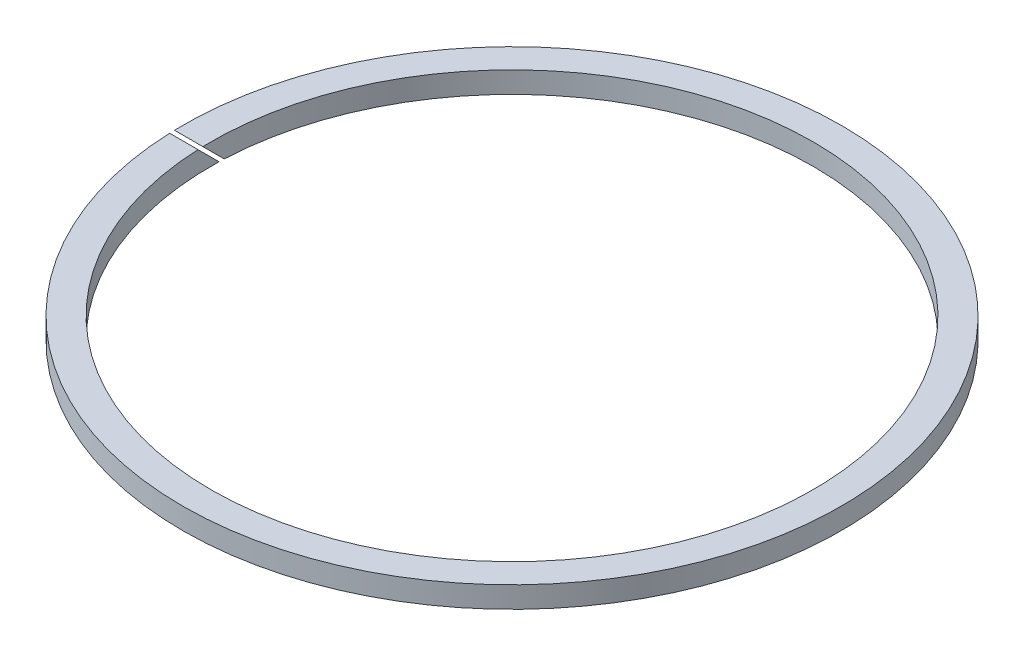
ISO-10303-21;
HEADER;
FILE_DESCRIPTION(('STEP AP214'),'2;1');
FILE_NAME('part.step','',(''),(''),'','','');
FILE_SCHEMA(('AUTOMOTIVE_DESIGN { 1 0 10303 214 1 1 1 1 }'));
ENDSEC;
DATA;
#1=APPLICATION_CONTEXT('core data for automotive mechanical design processes');
#2=APPLICATION_PROTOCOL_DEFINITION('international standard','automotive_design',2000,#1);
#3=PRODUCT_CONTEXT('',#1,'mechanical');
#4=PRODUCT('Part','Part','',(#3));
#5=PRODUCT_RELATED_PRODUCT_CATEGORY('part','',(#4));
#6=PRODUCT_DEFINITION_FORMATION('','',#4);
#7=PRODUCT_DEFINITION_CONTEXT('part definition',#1,'design');
#8=PRODUCT_DEFINITION('design','',#6,#7);
#9=PRODUCT_DEFINITION_SHAPE('','',#8);
#10=(LENGTH_UNIT() NAMED_UNIT(*) SI_UNIT(.MILLI.,.METRE.));
#11=(NAMED_UNIT(*) PLANE_ANGLE_UNIT() SI_UNIT($,.RADIAN.));
#12=(NAMED_UNIT(*) SI_UNIT($,.STERADIAN.) SOLID_ANGLE_UNIT());
#13=UNCERTAINTY_MEASURE_WITH_UNIT(LENGTH_MEASURE(1.E-05),#10,'distance_accuracy_value','');
#14=(GEOMETRIC_REPRESENTATION_CONTEXT(3) GLOBAL_UNCERTAINTY_ASSIGNED_CONTEXT((#13)) GLOBAL_UNIT_ASSIGNED_CONTEXT((#10,
#11,#12)) REPRESENTATION_CONTEXT('',''));
#15=CARTESIAN_POINT('',(0.,0.,0.));
#16=DIRECTION('',(0.,0.,1.));
#17=DIRECTION('',(1.,0.,0.));
#18=AXIS2_PLACEMENT_3D('',#15,#16,#17);
#19=CARTESIAN_POINT('',(0.,1.5,0.));
#20=DIRECTION('',(0.,1.,0.));
#21=DIRECTION('',(0.,0.,1.));
#22=AXIS2_PLACEMENT_3D('',#19,#20,#21);
#23=PLANE('',#22);
#24=DIRECTION('',(1.,0.,0.));
#25=VECTOR('',#24,1.);
#26=CARTESIAN_POINT('',(-46.5,1.5,1.14644660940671));
#27=LINE('',#26,#25);
#28=CARTESIAN_POINT('',(-46.4858651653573,1.5,1.14644660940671));
#29=VERTEX_POINT('',#28);
#30=CARTESIAN_POINT('',(-42.48453436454,1.5,1.14644660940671));
#31=VERTEX_POINT('',#30);
#32=EDGE_CURVE('E79',#29,#31,#27,.T.);
#33=ORIENTED_EDGE('',*,*,#32,.T.);
#34=CARTESIAN_POINT('',(0.,1.5,0.));
#35=DIRECTION('',(0.,1.,0.));
#36=DIRECTION('',(0.,0.,1.));
#37=AXIS2_PLACEMENT_3D('',#34,#35,#36);
#38=CIRCLE('',#37,42.5);
#39=CARTESIAN_POINT('',(-42.4595612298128,1.5,1.85355339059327));
#40=VERTEX_POINT('',#39);
#41=EDGE_CURVE('E87',#40,#31,#38,.T.);
#42=ORIENTED_EDGE('',*,*,#41,.F.);
#43=DIRECTION('',(1.,0.,0.));
#44=VECTOR('',#43,1.);
#45=CARTESIAN_POINT('',(-46.5,1.5,1.85355339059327));
#46=LINE('',#45,#44);
#47=CARTESIAN_POINT('',(-46.4630427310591,1.5,1.85355339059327));
#48=VERTEX_POINT('',#47);
#49=EDGE_CURVE('E54',#48,#40,#46,.T.);
#50=ORIENTED_EDGE('',*,*,#49,.F.);
#51=CARTESIAN_POINT('',(0.,1.5,0.));
#52=DIRECTION('',(0.,1.,0.));
#53=DIRECTION('',(0.,0.,1.));
#54=AXIS2_PLACEMENT_3D('',#51,#52,#53);
#55=CIRCLE('',#54,46.5);
#56=EDGE_CURVE('E85',#48,#29,#55,.T.);
#57=ORIENTED_EDGE('',*,*,#56,.T.);
#58=EDGE_LOOP('',(#33,#42,#50,#57));
#59=FACE_BOUND('',#58,.T.);
#60=ADVANCED_FACE('F32',(#59),#23,.T.);
#61=CARTESIAN_POINT('',(0.,-1.5,0.));
#62=DIRECTION('',(0.,1.,0.));
#63=DIRECTION('',(0.,0.,1.));
#64=AXIS2_PLACEMENT_3D('',#61,#62,#63);
#65=PLANE('',#64);
#66=CARTESIAN_POINT('',(0.,-1.5,0.));
#67=DIRECTION('',(0.,1.,0.));
#68=DIRECTION('',(0.,0.,1.));
#69=AXIS2_PLACEMENT_3D('',#66,#67,#68);
#70=CIRCLE('',#69,42.5);
#71=CARTESIAN_POINT('',(-42.48453436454,-1.5,-1.14644660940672));
#72=VERTEX_POINT('',#71);
#73=CARTESIAN_POINT('',(-42.4595612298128,-1.5,-1.85355339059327));
#74=VERTEX_POINT('',#73);
#75=EDGE_CURVE('E95',#72,#74,#70,.T.);
#76=ORIENTED_EDGE('',*,*,#75,.T.);
#77=DIRECTION('',(1.,0.,0.));
#78=VECTOR('',#77,1.);
#79=CARTESIAN_POINT('',(-46.5,-1.5,-1.85355339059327));
#80=LINE('',#79,#78);
#81=CARTESIAN_POINT('',(-46.4630427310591,-1.5,-1.85355339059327));
#82=VERTEX_POINT('',#81);
#83=EDGE_CURVE('E46',#82,#74,#80,.T.);
#84=ORIENTED_EDGE('',*,*,#83,.F.);
#85=CARTESIAN_POINT('',(0.,-1.5,0.));
#86=DIRECTION('',(0.,1.,0.));
#87=DIRECTION('',(0.,0.,1.));
#88=AXIS2_PLACEMENT_3D('',#85,#86,#87);
#89=CIRCLE('',#88,46.5);
#90=CARTESIAN_POINT('',(-46.4858651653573,-1.5,-1.14644660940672));
#91=VERTEX_POINT('',#90);
#92=EDGE_CURVE('E90',#91,#82,#89,.T.);
#93=ORIENTED_EDGE('',*,*,#92,.F.);
#94=DIRECTION('',(1.,0.,0.));
#95=VECTOR('',#94,1.);
#96=CARTESIAN_POINT('',(-46.5,-1.5,-1.14644660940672));
#97=LINE('',#96,#95);
#98=EDGE_CURVE('E73',#91,#72,#97,.T.);
#99=ORIENTED_EDGE('',*,*,#98,.T.);
#100=EDGE_LOOP('',(#76,#84,#93,#99));
#101=FACE_BOUND('',#100,.T.);
#102=ADVANCED_FACE('F105',(#101),#65,.F.);
#103=CARTESIAN_POINT('',(0.,1.5,0.));
#104=DIRECTION('',(0.,-1.,0.));
#105=DIRECTION('',(0.,0.,-1.));
#106=AXIS2_PLACEMENT_3D('',#103,#104,#105);
#107=CYLINDRICAL_SURFACE('',#106,46.5);
#108=ORIENTED_EDGE('',*,*,#92,.T.);
#109=CARTESIAN_POINT('',(0.,0.353553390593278,0.));
#110=DIRECTION('',(0.,0.707106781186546,-0.707106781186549));
#111=DIRECTION('',(0.,-0.707106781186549,-0.707106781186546));
#112=AXIS2_PLACEMENT_3D('',#109,#110,#111);
#113=ELLIPSE('',#112,65.7609306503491,46.5);
#114=EDGE_CURVE('E78',#82,#29,#113,.T.);
#115=ORIENTED_EDGE('',*,*,#114,.T.);
#116=ORIENTED_EDGE('',*,*,#56,.F.);
#117=CARTESIAN_POINT('',(0.,-0.353553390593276,0.));
#118=DIRECTION('',(0.,-0.707106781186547,0.707106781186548));
#119=DIRECTION('',(0.,-0.707106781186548,-0.707106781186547));
#120=AXIS2_PLACEMENT_3D('',#117,#118,#119);
#121=ELLIPSE('',#120,65.760930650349,46.5);
#122=EDGE_CURVE('E70',#48,#91,#121,.T.);
#123=ORIENTED_EDGE('',*,*,#122,.T.);
#124=EDGE_LOOP('',(#108,#115,#116,#123));
#125=FACE_BOUND('',#124,.T.);
#126=ADVANCED_FACE('F34',(#125),#107,.T.);
#127=CARTESIAN_POINT('',(0.,1.5,0.));
#128=DIRECTION('',(0.,-1.,0.));
#129=DIRECTION('',(0.,0.,-1.));
#130=AXIS2_PLACEMENT_3D('',#127,#128,#129);
#131=CYLINDRICAL_SURFACE('',#130,42.5);
#132=CARTESIAN_POINT('',(0.,0.353553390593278,0.));
#133=DIRECTION('',(0.,0.707106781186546,-0.707106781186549));
#134=DIRECTION('',(0.,-0.707106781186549,-0.707106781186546));
#135=AXIS2_PLACEMENT_3D('',#132,#133,#134);
#136=ELLIPSE('',#135,60.1040764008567,42.5);
#137=EDGE_CURVE('E11',#74,#31,#136,.T.);
#138=ORIENTED_EDGE('',*,*,#137,.F.);
#139=ORIENTED_EDGE('',*,*,#75,.F.);
#140=CARTESIAN_POINT('',(0.,-0.353553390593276,0.));
#141=DIRECTION('',(0.,-0.707106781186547,0.707106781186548));
#142=DIRECTION('',(0.,-0.707106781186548,-0.707106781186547));
#143=AXIS2_PLACEMENT_3D('',#140,#141,#142);
#144=ELLIPSE('',#143,60.1040764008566,42.5);
#145=EDGE_CURVE('E40',#40,#72,#144,.T.);
#146=ORIENTED_EDGE('',*,*,#145,.F.);
#147=ORIENTED_EDGE('',*,*,#41,.T.);
#148=EDGE_LOOP('',(#138,#139,#146,#147));
#149=FACE_BOUND('',#148,.T.);
#150=ADVANCED_FACE('F102',(#149),#131,.F.);
#151=CARTESIAN_POINT('',(-46.5,1.5,1.85355339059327));
#152=DIRECTION('',(0.,-0.707106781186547,0.707106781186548));
#153=DIRECTION('',(0.,-0.707106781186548,-0.707106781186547));
#154=AXIS2_PLACEMENT_3D('',#151,#152,#153);
#155=PLANE('',#154);
#156=ORIENTED_EDGE('',*,*,#49,.T.);
#157=ORIENTED_EDGE('',*,*,#145,.T.);
#158=ORIENTED_EDGE('',*,*,#98,.F.);
#159=ORIENTED_EDGE('',*,*,#122,.F.);
#160=EDGE_LOOP('',(#156,#157,#158,#159));
#161=FACE_BOUND('',#160,.T.);
#162=ADVANCED_FACE('F71',(#161),#155,.F.);
#163=CARTESIAN_POINT('',(-46.5,-1.5,-1.85355339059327));
#164=DIRECTION('',(0.,0.707106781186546,-0.707106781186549));
#165=DIRECTION('',(0.,0.707106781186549,0.707106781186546));
#166=AXIS2_PLACEMENT_3D('',#163,#164,#165);
#167=PLANE('',#166);
#168=ORIENTED_EDGE('',*,*,#83,.T.);
#169=ORIENTED_EDGE('',*,*,#137,.T.);
#170=ORIENTED_EDGE('',*,*,#32,.F.);
#171=ORIENTED_EDGE('',*,*,#114,.F.);
#172=EDGE_LOOP('',(#168,#169,#170,#171));
#173=FACE_BOUND('',#172,.T.);
#174=ADVANCED_FACE('F117',(#173),#167,.F.);
#175=CLOSED_SHELL('',(#60,#102,#126,#150,#162,#174));
#176=MANIFOLD_SOLID_BREP('B2',#175);
#177=ADVANCED_BREP_SHAPE_REPRESENTATION('',(#18,#176),#14);
#178=SHAPE_DEFINITION_REPRESENTATION(#9,#177);
ENDSEC;
END-ISO-10303-21;
